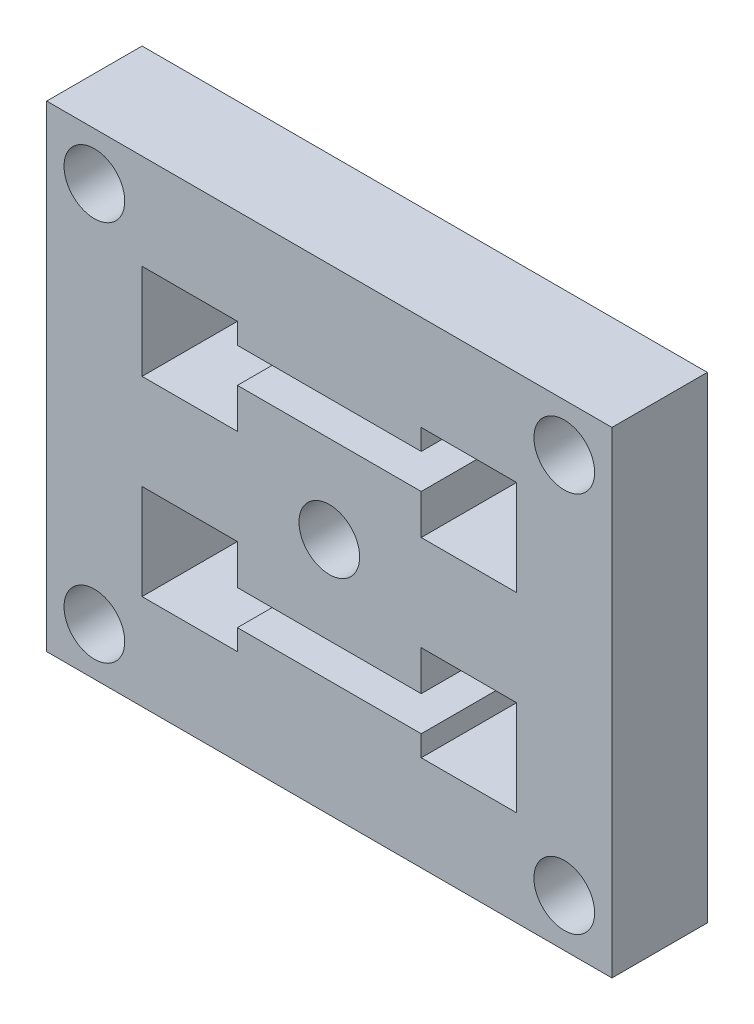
from build123d import *

# Parameters (mm, degrees)
SKETCH1_W           = 32.6
SKETCH1_H           = 27.5
SKETCH1_R           = 1.75
BOSS_EXTRUDE1_DEPTH = 5.5


with BuildPart() as part:
    # Sketch1 → Boss-Extrude1 (new body)
    with BuildSketch(Plane.XY):
        with Locations((-5.3, 6.05)):
            Rectangle(SKETCH1_W, SKETCH1_H)
        with Locations((-5.3, 6.05)):
            Circle(SKETCH1_R, mode=Mode.SUBTRACT)
        with Locations((-18.85, -4.95)):
            Circle(SKETCH1_R, mode=Mode.SUBTRACT)
        with Locations((-18.85, 17.05)):
            Circle(SKETCH1_R, mode=Mode.SUBTRACT)
        with Locations((8.25, 17.05)):
            Circle(SKETCH1_R, mode=Mode.SUBTRACT)
        with Locations((8.25, -4.95)):
            Circle(SKETCH1_R, mode=Mode.SUBTRACT)
        Polygon((-10.6, 8.8), (-16.1, 8.8), (-16.1, 14.3), (-10.6, 14.3), (-10.6, 13.1), (0, 13.1), (0, 14.3), (5.5, 14.3), (5.5, 8.8), (0, 8.8), (0, 11.1), (-10.6, 11.1), align=None, mode=Mode.SUBTRACT)
        Polygon((-16.1, 3.3), (-10.6, 3.3), (-10.6, 1), (0, 1), (0, 3.3), (5.5, 3.3), (5.5, -2.2), (0, -2.2), (0, -1), (-10.6, -1), (-10.6, -2.2), (-16.1, -2.2), align=None, mode=Mode.SUBTRACT)
    extrude(amount=BOSS_EXTRUDE1_DEPTH)


solid = part.part
